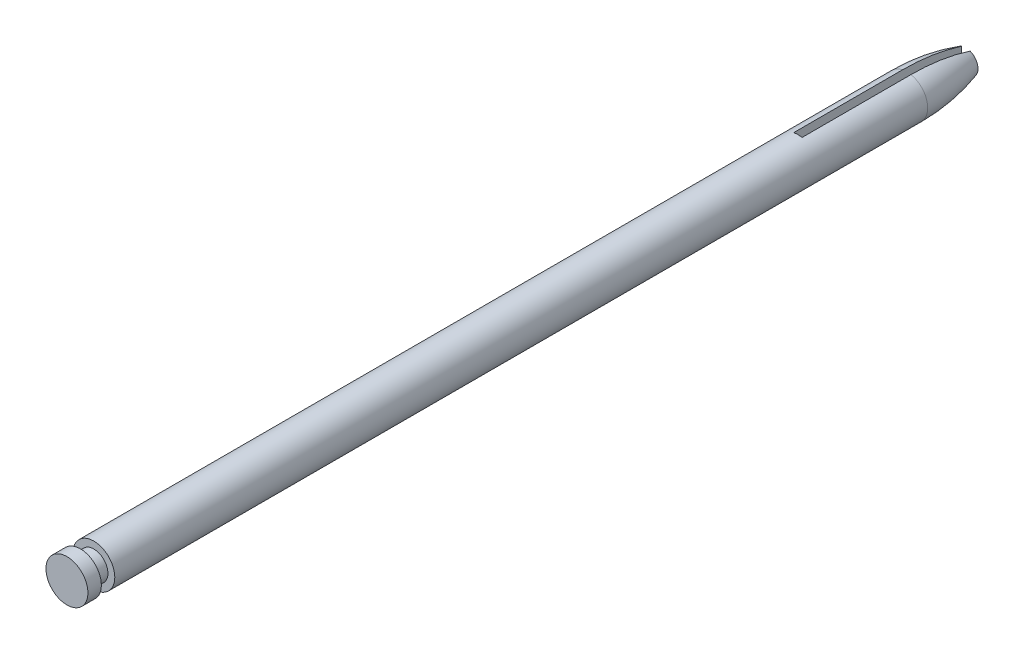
ISO-10303-21;
HEADER;
FILE_DESCRIPTION(('STEP AP214'),'2;1');
FILE_NAME('part.step','',(''),(''),'','','');
FILE_SCHEMA(('AUTOMOTIVE_DESIGN { 1 0 10303 214 1 1 1 1 }'));
ENDSEC;
DATA;
#1=APPLICATION_CONTEXT('core data for automotive mechanical design processes');
#2=APPLICATION_PROTOCOL_DEFINITION('international standard','automotive_design',2000,#1);
#3=PRODUCT_CONTEXT('',#1,'mechanical');
#4=PRODUCT('Part','Part','',(#3));
#5=PRODUCT_RELATED_PRODUCT_CATEGORY('part','',(#4));
#6=PRODUCT_DEFINITION_FORMATION('','',#4);
#7=PRODUCT_DEFINITION_CONTEXT('part definition',#1,'design');
#8=PRODUCT_DEFINITION('design','',#6,#7);
#9=PRODUCT_DEFINITION_SHAPE('','',#8);
#10=(LENGTH_UNIT() NAMED_UNIT(*) SI_UNIT(.MILLI.,.METRE.));
#11=(NAMED_UNIT(*) PLANE_ANGLE_UNIT() SI_UNIT($,.RADIAN.));
#12=(NAMED_UNIT(*) SI_UNIT($,.STERADIAN.) SOLID_ANGLE_UNIT());
#13=UNCERTAINTY_MEASURE_WITH_UNIT(LENGTH_MEASURE(1.E-05),#10,'distance_accuracy_value','');
#14=(GEOMETRIC_REPRESENTATION_CONTEXT(3) GLOBAL_UNCERTAINTY_ASSIGNED_CONTEXT((#13)) GLOBAL_UNIT_ASSIGNED_CONTEXT((#10,
#11,#12)) REPRESENTATION_CONTEXT('',''));
#15=CARTESIAN_POINT('',(0.,0.,0.));
#16=DIRECTION('',(0.,0.,1.));
#17=DIRECTION('',(1.,0.,0.));
#18=AXIS2_PLACEMENT_3D('',#15,#16,#17);
#19=CARTESIAN_POINT('',(0.,0.,-79.34325));
#20=DIRECTION('',(0.,0.,1.));
#21=DIRECTION('',(1.,0.,0.));
#22=AXIS2_PLACEMENT_3D('',#19,#20,#21);
#23=DEGENERATE_TOROIDAL_SURFACE('',#22,17.0688,19.05,.F.);
#24=CARTESIAN_POINT('',(0.,0.,-84.93125));
#25=DIRECTION('',(0.,0.,1.));
#26=DIRECTION('',(1.,0.,0.));
#27=AXIS2_PLACEMENT_3D('',#24,#25,#26);
#28=CIRCLE('',#27,1.14319483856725);
#29=CARTESIAN_POINT('',(-0.396875,1.0720935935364,-84.93125));
#30=VERTEX_POINT('',#29);
#31=CARTESIAN_POINT('',(-0.396875,-1.0720935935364,-84.93125));
#32=VERTEX_POINT('',#31);
#33=EDGE_CURVE('E135',#30,#32,#28,.T.);
#34=ORIENTED_EDGE('',*,*,#33,.T.);
#35=CARTESIAN_POINT('',(-0.396875,0.,-86.9493460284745));
#36=CARTESIAN_POINT('',(-0.396875,-0.0107824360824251,-86.9493458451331));
#37=CARTESIAN_POINT('',(-0.396875,-0.021565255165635,-86.9483229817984));
#38=CARTESIAN_POINT('',(-0.396875,-0.0427815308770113,-86.9443883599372));
#39=CARTESIAN_POINT('',(-0.396875,-0.053214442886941,-86.9414737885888));
#40=CARTESIAN_POINT('',(-0.396875,-0.0773195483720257,-86.9327332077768));
#41=CARTESIAN_POINT('',(-0.396875,-0.0907391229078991,-86.926225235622));
#42=CARTESIAN_POINT('',(-0.396875,-0.116435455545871,-86.911258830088));
#43=CARTESIAN_POINT('',(-0.396875,-0.128708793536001,-86.9027948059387));
#44=CARTESIAN_POINT('',(-0.396875,-0.155961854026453,-86.8817320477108));
#45=CARTESIAN_POINT('',(-0.396875,-0.170577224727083,-86.8686704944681));
#46=CARTESIAN_POINT('',(-0.396875,-0.198515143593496,-86.8412148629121));
#47=CARTESIAN_POINT('',(-0.396875,-0.211834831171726,-86.8268179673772));
#48=CARTESIAN_POINT('',(-0.396875,-0.237562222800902,-86.7970789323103));
#49=CARTESIAN_POINT('',(-0.396875,-0.24996355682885,-86.7817313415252));
#50=CARTESIAN_POINT('',(-0.396875,-0.273975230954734,-86.7504622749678));
#51=CARTESIAN_POINT('',(-0.396875,-0.285586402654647,-86.7345414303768));
#52=CARTESIAN_POINT('',(-0.396875,-0.321806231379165,-86.6828866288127));
#53=CARTESIAN_POINT('',(-0.396875,-0.345257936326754,-86.6463448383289));
#54=CARTESIAN_POINT('',(-0.396875,-0.390299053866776,-86.5721228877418));
#55=CARTESIAN_POINT('',(-0.396875,-0.411887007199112,-86.5344418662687));
#56=CARTESIAN_POINT('',(-0.396875,-0.453764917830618,-86.4582573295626));
#57=CARTESIAN_POINT('',(-0.396875,-0.474051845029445,-86.4197521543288));
#58=CARTESIAN_POINT('',(-0.396875,-0.513595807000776,-86.3422147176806));
#59=CARTESIAN_POINT('',(-0.396875,-0.532852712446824,-86.3031823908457));
#60=CARTESIAN_POINT('',(-0.396875,-0.58939622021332,-86.1854854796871));
#61=CARTESIAN_POINT('',(-0.396875,-0.625451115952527,-86.1062294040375));
#62=CARTESIAN_POINT('',(-0.396875,-0.695124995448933,-85.9468030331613));
#63=CARTESIAN_POINT('',(-0.396875,-0.728747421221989,-85.8666342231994));
#64=CARTESIAN_POINT('',(-0.396875,-0.79399554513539,-85.7056378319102));
#65=CARTESIAN_POINT('',(-0.396875,-0.825624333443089,-85.6248115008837));
#66=CARTESIAN_POINT('',(-0.396875,-0.887194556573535,-85.4625182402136));
#67=CARTESIAN_POINT('',(-0.396875,-0.917135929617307,-85.3810512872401));
#68=CARTESIAN_POINT('',(-0.396875,-1.00467914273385,-85.1358013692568));
#69=CARTESIAN_POINT('',(-0.396875,-1.05998911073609,-84.9711967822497));
#70=CARTESIAN_POINT('',(-0.396875,-1.16521786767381,-84.6400428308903));
#71=CARTESIAN_POINT('',(-0.396875,-1.21512939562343,-84.4734911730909));
#72=CARTESIAN_POINT('',(-0.396875,-1.3097587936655,-84.1389436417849));
#73=CARTESIAN_POINT('',(-0.396875,-1.35447716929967,-83.9709479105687));
#74=CARTESIAN_POINT('',(-0.396875,-1.48107967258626,-83.4651461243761));
#75=CARTESIAN_POINT('',(-0.396875,-1.55544238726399,-83.1254262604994));
#76=CARTESIAN_POINT('',(-0.396875,-1.68454646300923,-82.4425150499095));
#77=CARTESIAN_POINT('',(-0.396875,-1.73929785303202,-82.0993255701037));
#78=CARTESIAN_POINT('',(-0.396875,-1.85219465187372,-81.235780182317));
#79=CARTESIAN_POINT('',(-0.396875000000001,-1.89800441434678,-80.7137604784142));
#80=CARTESIAN_POINT('',(-0.396875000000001,-1.94558309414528,-79.6674252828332));
#81=CARTESIAN_POINT('',(-0.396875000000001,-1.94732305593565,-79.1431085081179));
#82=CARTESIAN_POINT('',(-0.396875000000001,-1.90671472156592,-78.0967646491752));
#83=CARTESIAN_POINT('',(-0.396875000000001,-1.86441427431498,-77.5747356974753));
#84=CARTESIAN_POINT('',(-0.396875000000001,-1.73580139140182,-76.5363930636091));
#85=CARTESIAN_POINT('',(-0.396875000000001,-1.64952063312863,-76.0200755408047));
#86=CARTESIAN_POINT('',(-0.396875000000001,-1.49892954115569,-75.3104680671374));
#87=CARTESIAN_POINT('',(-0.396875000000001,-1.45353217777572,-75.1130275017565));
#88=CARTESIAN_POINT('',(-0.396875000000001,-1.3559118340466,-74.7198151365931));
#89=CARTESIAN_POINT('',(-0.396875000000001,-1.30368857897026,-74.5240434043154));
#90=CARTESIAN_POINT('',(-0.396875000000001,-1.19219252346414,-74.1345884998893));
#91=CARTESIAN_POINT('',(-0.396875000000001,-1.13292200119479,-73.9409046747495));
#92=CARTESIAN_POINT('',(-0.396875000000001,-1.00683910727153,-73.5560780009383));
#93=CARTESIAN_POINT('',(-0.396875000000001,-0.940030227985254,-73.3649340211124));
#94=CARTESIAN_POINT('',(-0.396875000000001,-0.832697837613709,-73.0796872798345));
#95=CARTESIAN_POINT('',(-0.396875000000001,-0.795507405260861,-72.9843251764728));
#96=CARTESIAN_POINT('',(-0.396875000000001,-0.718386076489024,-72.7946018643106));
#97=CARTESIAN_POINT('',(-0.396875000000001,-0.678452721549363,-72.7002416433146));
#98=CARTESIAN_POINT('',(-0.396875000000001,-0.615865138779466,-72.559762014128));
#99=CARTESIAN_POINT('',(-0.396875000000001,-0.594526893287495,-72.5130556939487));
#100=CARTESIAN_POINT('',(-0.396875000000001,-0.550775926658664,-72.4201504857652));
#101=CARTESIAN_POINT('',(-0.396875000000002,-0.528363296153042,-72.3739515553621));
#102=CARTESIAN_POINT('',(-0.396875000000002,-0.482207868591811,-72.2823121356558));
#103=CARTESIAN_POINT('',(-0.396875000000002,-0.458467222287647,-72.236870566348));
#104=CARTESIAN_POINT('',(-0.396875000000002,-0.409147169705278,-72.1470028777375));
#105=CARTESIAN_POINT('',(-0.396875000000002,-0.383568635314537,-72.1025762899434));
#106=CARTESIAN_POINT('',(-0.396875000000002,-0.342993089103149,-72.0370600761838));
#107=CARTESIAN_POINT('',(-0.396875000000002,-0.329040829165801,-72.0153256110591));
#108=CARTESIAN_POINT('',(-0.396875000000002,-0.300185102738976,-71.972452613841));
#109=CARTESIAN_POINT('',(-0.396875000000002,-0.285280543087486,-71.9513148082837));
#110=CARTESIAN_POINT('',(-0.396875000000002,-0.254321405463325,-71.9101132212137));
#111=CARTESIAN_POINT('',(-0.396875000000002,-0.238275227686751,-71.89004317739));
#112=CARTESIAN_POINT('',(-0.396875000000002,-0.204472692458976,-71.8514186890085));
#113=CARTESIAN_POINT('',(-0.396875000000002,-0.18672047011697,-71.832860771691));
#114=CARTESIAN_POINT('',(-0.396875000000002,-0.155889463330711,-71.8049702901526));
#115=CARTESIAN_POINT('',(-0.396875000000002,-0.143578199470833,-71.7948008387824));
#116=CARTESIAN_POINT('',(-0.396875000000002,-0.117744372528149,-71.7761096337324));
#117=CARTESIAN_POINT('',(-0.396875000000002,-0.104223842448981,-71.7675851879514));
#118=CARTESIAN_POINT('',(-0.396875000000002,-0.080120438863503,-71.7552992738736));
#119=CARTESIAN_POINT('',(-0.396875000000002,-0.0698808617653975,-71.7508766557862));
#120=CARTESIAN_POINT('',(-0.396875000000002,-0.0488279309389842,-71.7437180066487));
#121=CARTESIAN_POINT('',(-0.396875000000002,-0.0380156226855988,-71.7409790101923));
#122=CARTESIAN_POINT('',(-0.396875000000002,-0.0159508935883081,-71.7375374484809));
#123=CARTESIAN_POINT('',(-0.396875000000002,-0.00469524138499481,-71.7368547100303));
#124=CARTESIAN_POINT('',(-0.396875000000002,0.017733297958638,-71.7376991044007));
#125=CARTESIAN_POINT('',(-0.396875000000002,0.0289061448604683,-71.7392272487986));
#126=CARTESIAN_POINT('',(-0.396875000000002,0.0519968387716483,-71.7445250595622));
#127=CARTESIAN_POINT('',(-0.396875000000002,0.0638602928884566,-71.7485240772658));
#128=CARTESIAN_POINT('',(-0.396875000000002,0.0867937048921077,-71.7583649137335));
#129=CARTESIAN_POINT('',(-0.396875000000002,0.0978617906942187,-71.7642109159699));
#130=CARTESIAN_POINT('',(-0.396875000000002,0.127577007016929,-71.7822937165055));
#131=CARTESIAN_POINT('',(-0.396875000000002,0.145346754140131,-71.795942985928));
#132=CARTESIAN_POINT('',(-0.396875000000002,0.178933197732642,-71.8254498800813));
#133=CARTESIAN_POINT('',(-0.396875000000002,0.194742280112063,-71.8413156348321));
#134=CARTESIAN_POINT('',(-0.396875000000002,0.223846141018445,-71.8731568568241));
#135=CARTESIAN_POINT('',(-0.396875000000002,0.237239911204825,-71.8890430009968));
#136=CARTESIAN_POINT('',(-0.396875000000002,0.263098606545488,-71.9215593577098));
#137=CARTESIAN_POINT('',(-0.396875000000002,0.27556294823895,-71.9381900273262));
#138=CARTESIAN_POINT('',(-0.396875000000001,0.311941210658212,-71.9889155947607));
#139=CARTESIAN_POINT('',(-0.396875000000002,0.334782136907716,-72.023775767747));
#140=CARTESIAN_POINT('',(-0.396875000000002,0.378734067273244,-72.0947966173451));
#141=CARTESIAN_POINT('',(-0.396875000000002,0.399835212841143,-72.1309632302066));
#142=CARTESIAN_POINT('',(-0.396875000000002,0.440672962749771,-72.203986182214));
#143=CARTESIAN_POINT('',(-0.396875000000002,0.460411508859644,-72.2408414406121));
#144=CARTESIAN_POINT('',(-0.396875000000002,0.517712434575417,-72.3513637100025));
#145=CARTESIAN_POINT('',(-0.396875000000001,0.553825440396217,-72.425778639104));
#146=CARTESIAN_POINT('',(-0.396875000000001,0.623453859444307,-72.575822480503));
#147=CARTESIAN_POINT('',(-0.396875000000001,0.656968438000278,-72.651451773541));
#148=CARTESIAN_POINT('',(-0.396875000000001,0.722017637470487,-72.8036823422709));
#149=CARTESIAN_POINT('',(-0.396875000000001,0.753549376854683,-72.8802848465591));
#150=CARTESIAN_POINT('',(-0.396875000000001,0.814906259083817,-73.0341544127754));
#151=CARTESIAN_POINT('',(-0.396875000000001,0.844731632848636,-73.1114213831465));
#152=CARTESIAN_POINT('',(-0.396875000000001,0.931773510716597,-73.3435593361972));
#153=CARTESIAN_POINT('',(-0.396875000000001,0.986765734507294,-73.4992677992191));
#154=CARTESIAN_POINT('',(-0.396875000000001,1.09157110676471,-73.8122890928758));
#155=CARTESIAN_POINT('',(-0.396875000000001,1.141387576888,-73.96960082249));
#156=CARTESIAN_POINT('',(-0.396875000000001,1.26118741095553,-74.3687712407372));
#157=CARTESIAN_POINT('',(-0.396875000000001,1.32800010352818,-74.6115887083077));
#158=CARTESIAN_POINT('',(-0.396875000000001,1.45108270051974,-75.099893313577));
#159=CARTESIAN_POINT('',(-0.396875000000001,1.50735075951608,-75.3453809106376));
#160=CARTESIAN_POINT('',(-0.396875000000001,1.6607637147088,-76.0855321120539));
#161=CARTESIAN_POINT('',(-0.396875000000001,1.74240302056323,-76.5834980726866));
#162=CARTESIAN_POINT('',(-0.396875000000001,1.86510514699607,-77.5868950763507));
#163=CARTESIAN_POINT('',(-0.396875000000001,1.90595919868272,-78.0923512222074));
#164=CARTESIAN_POINT('',(-0.396875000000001,1.94638596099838,-79.1045313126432));
#165=CARTESIAN_POINT('',(-0.396875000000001,1.94598949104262,-79.6112540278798));
#166=CARTESIAN_POINT('',(-0.396875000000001,1.90396028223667,-80.6236609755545));
#167=CARTESIAN_POINT('',(-0.396875,1.86227818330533,-81.129343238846));
#168=CARTESIAN_POINT('',(-0.396875,1.76871168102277,-81.8842414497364));
#169=CARTESIAN_POINT('',(-0.396875,1.73230823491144,-82.1354653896));
#170=CARTESIAN_POINT('',(-0.396875,1.64909518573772,-82.6361766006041));
#171=CARTESIAN_POINT('',(-0.396875,1.60228665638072,-82.8856640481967));
#172=CARTESIAN_POINT('',(-0.396875,1.49851160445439,-83.3807716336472));
#173=CARTESIAN_POINT('',(-0.396875,1.4416150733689,-83.6264064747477));
#174=CARTESIAN_POINT('',(-0.396875,1.31720742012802,-84.1150848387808));
#175=CARTESIAN_POINT('',(-0.396875,1.24969265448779,-84.3581274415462));
#176=CARTESIAN_POINT('',(-0.396875,1.1400914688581,-84.7198858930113));
#177=CARTESIAN_POINT('',(-0.396875,1.10221099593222,-84.8398875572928));
#178=CARTESIAN_POINT('',(-0.396875,1.02349451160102,-85.0789154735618));
#179=CARTESIAN_POINT('',(-0.396875,0.982658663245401,-85.1979417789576));
#180=CARTESIAN_POINT('',(-0.396875,0.89777578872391,-85.4347692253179));
#181=CARTESIAN_POINT('',(-0.396875,0.853730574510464,-85.552571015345));
#182=CARTESIAN_POINT('',(-0.396875,0.761903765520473,-85.7867013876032));
#183=CARTESIAN_POINT('',(-0.396875,0.714122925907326,-85.9030302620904));
#184=CARTESIAN_POINT('',(-0.396875,0.650423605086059,-86.0491557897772));
#185=CARTESIAN_POINT('',(-0.396875,0.636789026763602,-86.0799511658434));
#186=CARTESIAN_POINT('',(-0.396875,0.609117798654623,-86.1413604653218));
#187=CARTESIAN_POINT('',(-0.396875,0.595081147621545,-86.1719743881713));
#188=CARTESIAN_POINT('',(-0.396875,0.552294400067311,-86.2635191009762));
#189=CARTESIAN_POINT('',(-0.396875,0.522872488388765,-86.3241413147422));
#190=CARTESIAN_POINT('',(-0.396875,0.471686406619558,-86.4243072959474));
#191=CARTESIAN_POINT('',(-0.396875,0.450603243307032,-86.4641987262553));
#192=CARTESIAN_POINT('',(-0.396875,0.406980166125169,-86.5431391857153));
#193=CARTESIAN_POINT('',(-0.396875,0.384441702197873,-86.5821890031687));
#194=CARTESIAN_POINT('',(-0.396875,0.344939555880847,-86.6464691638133));
#195=CARTESIAN_POINT('',(-0.396875,0.328554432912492,-86.6720537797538));
#196=CARTESIAN_POINT('',(-0.396875,0.294422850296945,-86.7224189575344));
#197=CARTESIAN_POINT('',(-0.396875,0.276672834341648,-86.7471971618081));
#198=CARTESIAN_POINT('',(-0.396875,0.239135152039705,-86.7955214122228));
#199=CARTESIAN_POINT('',(-0.396875,0.21933060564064,-86.8190543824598));
#200=CARTESIAN_POINT('',(-0.396875,0.176845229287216,-86.8633948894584));
#201=CARTESIAN_POINT('',(-0.396875,0.15417958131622,-86.884215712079));
#202=CARTESIAN_POINT('',(-0.396875,0.11897061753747,-86.9094189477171));
#203=CARTESIAN_POINT('',(-0.396875,0.108252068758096,-86.9162974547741));
#204=CARTESIAN_POINT('',(-0.396875,0.0859631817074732,-86.9285139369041));
#205=CARTESIAN_POINT('',(-0.396875,0.0743942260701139,-86.9338543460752));
#206=CARTESIAN_POINT('',(-0.396875,0.0524243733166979,-86.9417054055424));
#207=CARTESIAN_POINT('',(-0.396875,0.0421403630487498,-86.9445353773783));
#208=CARTESIAN_POINT('',(-0.396875,0.021237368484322,-86.9483545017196));
#209=CARTESIAN_POINT('',(-0.396875,0.010618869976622,-86.9493462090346));
#210=CARTESIAN_POINT('',(-0.396875,0.,-86.9493460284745));
#211=B_SPLINE_CURVE_WITH_KNOTS('',3,(#35,#36,#37,#38,#39,#40,#41,#42,#43,#44,#45,#46,#47,#48,
#49,#50,#51,#52,#53,#54,#55,#56,#57,#58,#59,#60,#61,#62,#63,#64,#65,#66,#67,#68,#69,#70,#71,#72,
#73,#74,#75,#76,#77,#78,#79,#80,#81,#82,#83,#84,#85,#86,#87,#88,#89,#90,#91,#92,#93,#94,#95,#96,
#97,#98,#99,#100,#101,#102,#103,#104,#105,#106,#107,#108,#109,#110,#111,#112,#113,#114,#115,
#116,#117,#118,#119,#120,#121,#122,#123,#124,#125,#126,#127,#128,#129,#130,#131,#132,#133,#134,
#135,#136,#137,#138,#139,#140,#141,#142,#143,#144,#145,#146,#147,#148,#149,#150,#151,#152,#153,
#154,#155,#156,#157,#158,#159,#160,#161,#162,#163,#164,#165,#166,#167,#168,#169,#170,#171,#172,
#173,#174,#175,#176,#177,#178,#179,#180,#181,#182,#183,#184,#185,#186,#187,#188,#189,#190,#191,
#192,#193,#194,#195,#196,#197,#198,#199,#200,#201,#202,#203,#204,#205,#206,#207,#208,#209,#210),
.UNSPECIFIED.,.T.,.F.,(4,2,2,2,2,2,2,2,2,2,2,2,2,2,2,2,2,2,2,2,2,2,2,2,2,2,2,2,2,2,2,2,2,2,2,2,
2,2,2,2,2,2,2,2,2,2,2,2,2,2,2,2,2,2,2,2,2,2,2,2,2,2,2,2,2,2,2,2,2,2,2,2,2,2,2,2,2,2,2,2,2,2,2,2,
2,2,2,4),(0.,0.0323040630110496,0.0646562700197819,0.109142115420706,0.15375671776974,
0.212416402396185,0.271202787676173,0.330364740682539,0.389463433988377,0.519614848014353,
0.649867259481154,0.78041276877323,0.910974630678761,1.17212701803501,1.43290233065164,
1.69326295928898,1.95363311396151,2.47446200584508,2.99598293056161,3.51745304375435,
4.56008174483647,5.60217649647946,7.17226576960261,8.74338662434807,10.3128022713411,
11.8810891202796,12.4887798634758,13.0964950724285,13.7040143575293,14.3112533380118,
14.6182981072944,14.9256217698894,15.0796614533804,15.2336881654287,15.3874722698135,
15.5411838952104,15.6186497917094,15.6962062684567,15.7732416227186,15.8500947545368,
15.8979187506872,15.9456638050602,15.9790141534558,16.0123055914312,16.0459170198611,
16.0795438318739,16.1168920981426,16.1543255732,16.221169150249,16.288264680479,
16.3505524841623,16.4128790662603,16.5378004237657,16.6633869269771,16.7887906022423,
17.0368479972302,17.2849847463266,17.5334741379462,17.7819298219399,18.27721425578,
18.772178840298,19.5274247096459,20.2828026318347,21.7947625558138,23.3144227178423,
24.8329475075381,26.3532900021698,27.1146551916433,27.87594185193,28.6321397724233,
29.3885977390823,29.7660832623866,30.1435479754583,30.5208012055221,30.8979783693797,
30.9990120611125,31.1000460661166,31.3021517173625,31.4374935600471,31.5727025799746,
31.6638239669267,31.7551913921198,31.8473800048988,31.9390985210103,31.9772200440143,
32.0152809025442,32.0471392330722,32.0789532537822),.UNSPECIFIED.);
#212=CARTESIAN_POINT('',(-0.396875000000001,-1.94104190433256,-79.34325));
#213=VERTEX_POINT('',#212);
#214=EDGE_CURVE('E140',#32,#213,#211,.T.);
#215=ORIENTED_EDGE('',*,*,#214,.T.);
#216=CARTESIAN_POINT('',(0.,0.,-79.34325));
#217=DIRECTION('',(0.,0.,1.));
#218=DIRECTION('',(1.,0.,0.));
#219=AXIS2_PLACEMENT_3D('',#216,#217,#218);
#220=CIRCLE('',#219,1.9812);
#221=CARTESIAN_POINT('',(-0.396875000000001,1.94104190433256,-79.34325));
#222=VERTEX_POINT('',#221);
#223=EDGE_CURVE('E132',#222,#213,#220,.T.);
#224=ORIENTED_EDGE('',*,*,#223,.F.);
#225=EDGE_CURVE('E144',#222,#30,#211,.T.);
#226=ORIENTED_EDGE('',*,*,#225,.T.);
#227=EDGE_LOOP('',(#34,#215,#224,#226));
#228=FACE_BOUND('',#227,.T.);
#229=ADVANCED_FACE('F36',(#228),#23,.F.);
#230=CARTESIAN_POINT('',(0.,0.,-84.93125));
#231=DIRECTION('',(0.,0.,1.));
#232=DIRECTION('',(1.,0.,0.));
#233=AXIS2_PLACEMENT_3D('',#230,#231,#232);
#234=PLANE('',#233);
#235=ORIENTED_EDGE('',*,*,#33,.F.);
#236=DIRECTION('',(0.,-1.,0.));
#237=VECTOR('',#236,1.);
#238=CARTESIAN_POINT('',(-0.396875,0.,-84.93125));
#239=LINE('',#238,#237);
#240=EDGE_CURVE('E109',#30,#32,#239,.T.);
#241=ORIENTED_EDGE('',*,*,#240,.T.);
#242=EDGE_LOOP('',(#235,#241));
#243=FACE_BOUND('',#242,.T.);
#244=ADVANCED_FACE('F164',(#243),#234,.F.);
#245=CARTESIAN_POINT('',(0.,0.,0.));
#246=DIRECTION('',(0.,0.,-1.));
#247=DIRECTION('',(-1.,0.,0.));
#248=AXIS2_PLACEMENT_3D('',#245,#246,#247);
#249=PLANE('',#248);
#250=CARTESIAN_POINT('',(0.,0.,0.));
#251=DIRECTION('',(0.,0.,1.));
#252=DIRECTION('',(1.,0.,0.));
#253=AXIS2_PLACEMENT_3D('',#250,#251,#252);
#254=CIRCLE('',#253,1.9812);
#255=CARTESIAN_POINT('',(1.9812,0.,0.));
#256=VERTEX_POINT('',#255);
#257=EDGE_CURVE('E115',#256,#256,#254,.T.);
#258=ORIENTED_EDGE('',*,*,#257,.T.);
#259=EDGE_LOOP('',(#258));
#260=FACE_BOUND('',#259,.T.);
#261=ADVANCED_FACE('F38',(#260),#249,.F.);
#262=CARTESIAN_POINT('',(0.,0.,0.));
#263=DIRECTION('',(0.,0.,1.));
#264=DIRECTION('',(1.,0.,0.));
#265=AXIS2_PLACEMENT_3D('',#262,#263,#264);
#266=CYLINDRICAL_SURFACE('',#265,1.9812);
#267=ORIENTED_EDGE('',*,*,#257,.F.);
#268=EDGE_LOOP('',(#267));
#269=FACE_BOUND('',#268,.T.);
#270=CARTESIAN_POINT('',(0.,0.,-1.27));
#271=DIRECTION('',(0.,0.,1.));
#272=DIRECTION('',(1.,0.,0.));
#273=AXIS2_PLACEMENT_3D('',#270,#271,#272);
#274=CIRCLE('',#273,1.9812);
#275=CARTESIAN_POINT('',(1.9812,0.,-1.27));
#276=VERTEX_POINT('',#275);
#277=EDGE_CURVE('E120',#276,#276,#274,.T.);
#278=ORIENTED_EDGE('',*,*,#277,.T.);
#279=EDGE_LOOP('',(#278));
#280=FACE_BOUND('',#279,.T.);
#281=ADVANCED_FACE('F242',(#269,#280),#266,.T.);
#282=CARTESIAN_POINT('',(0.,1.9812,-1.27));
#283=DIRECTION('',(0.,0.,1.));
#284=DIRECTION('',(1.,0.,0.));
#285=AXIS2_PLACEMENT_3D('',#282,#283,#284);
#286=PLANE('',#285);
#287=ORIENTED_EDGE('',*,*,#277,.F.);
#288=EDGE_LOOP('',(#287));
#289=FACE_BOUND('',#288,.T.);
#290=CARTESIAN_POINT('',(0.,0.,-1.27));
#291=DIRECTION('',(0.,0.,1.));
#292=DIRECTION('',(1.,0.,0.));
#293=AXIS2_PLACEMENT_3D('',#290,#291,#292);
#294=CIRCLE('',#293,1.3335);
#295=CARTESIAN_POINT('',(1.3335,0.,-1.27));
#296=VERTEX_POINT('',#295);
#297=EDGE_CURVE('E123',#296,#296,#294,.T.);
#298=ORIENTED_EDGE('',*,*,#297,.T.);
#299=EDGE_LOOP('',(#298));
#300=FACE_BOUND('',#299,.T.);
#301=ADVANCED_FACE('F234',(#289,#300),#286,.F.);
#302=CARTESIAN_POINT('',(0.,0.,0.));
#303=DIRECTION('',(0.,0.,1.));
#304=DIRECTION('',(1.,0.,0.));
#305=AXIS2_PLACEMENT_3D('',#302,#303,#304);
#306=CYLINDRICAL_SURFACE('',#305,1.3335);
#307=ORIENTED_EDGE('',*,*,#297,.F.);
#308=EDGE_LOOP('',(#307));
#309=FACE_BOUND('',#308,.T.);
#310=CARTESIAN_POINT('',(0.,0.,-2.54));
#311=DIRECTION('',(0.,0.,1.));
#312=DIRECTION('',(1.,0.,0.));
#313=AXIS2_PLACEMENT_3D('',#310,#311,#312);
#314=CIRCLE('',#313,1.3335);
#315=CARTESIAN_POINT('',(1.3335,0.,-2.54));
#316=VERTEX_POINT('',#315);
#317=EDGE_CURVE('E126',#316,#316,#314,.T.);
#318=ORIENTED_EDGE('',*,*,#317,.T.);
#319=EDGE_LOOP('',(#318));
#320=FACE_BOUND('',#319,.T.);
#321=ADVANCED_FACE('F227',(#309,#320),#306,.T.);
#322=CARTESIAN_POINT('',(0.,1.3335,-2.54));
#323=DIRECTION('',(0.,0.,-1.));
#324=DIRECTION('',(-1.,0.,0.));
#325=AXIS2_PLACEMENT_3D('',#322,#323,#324);
#326=PLANE('',#325);
#327=ORIENTED_EDGE('',*,*,#317,.F.);
#328=EDGE_LOOP('',(#327));
#329=FACE_BOUND('',#328,.T.);
#330=CARTESIAN_POINT('',(0.,0.,-2.54));
#331=DIRECTION('',(0.,0.,1.));
#332=DIRECTION('',(1.,0.,0.));
#333=AXIS2_PLACEMENT_3D('',#330,#331,#332);
#334=CIRCLE('',#333,1.9812);
#335=CARTESIAN_POINT('',(1.9812,0.,-2.54));
#336=VERTEX_POINT('',#335);
#337=EDGE_CURVE('E129',#336,#336,#334,.T.);
#338=ORIENTED_EDGE('',*,*,#337,.T.);
#339=EDGE_LOOP('',(#338));
#340=FACE_BOUND('',#339,.T.);
#341=ADVANCED_FACE('F220',(#329,#340),#326,.F.);
#342=CARTESIAN_POINT('',(0.,0.,0.));
#343=DIRECTION('',(0.,0.,1.));
#344=DIRECTION('',(1.,0.,0.));
#345=AXIS2_PLACEMENT_3D('',#342,#343,#344);
#346=CYLINDRICAL_SURFACE('',#345,1.9812);
#347=CARTESIAN_POINT('',(0.,0.,-69.05625));
#348=DIRECTION('',(0.,0.,1.));
#349=DIRECTION('',(1.,0.,0.));
#350=AXIS2_PLACEMENT_3D('',#347,#348,#349);
#351=CIRCLE('',#350,1.9812);
#352=CARTESIAN_POINT('',(0.396875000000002,1.94104190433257,-69.05625));
#353=VERTEX_POINT('',#352);
#354=CARTESIAN_POINT('',(-0.396875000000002,1.94104190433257,-69.05625));
#355=VERTEX_POINT('',#354);
#356=EDGE_CURVE('E11',#353,#355,#351,.T.);
#357=ORIENTED_EDGE('',*,*,#356,.T.);
#358=DIRECTION('',(0.,0.,1.));
#359=VECTOR('',#358,1.);
#360=CARTESIAN_POINT('',(-0.39687500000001,1.94104190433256,0.));
#361=LINE('',#360,#359);
#362=EDGE_CURVE('E141',#355,#222,#361,.F.);
#363=ORIENTED_EDGE('',*,*,#362,.T.);
#364=ORIENTED_EDGE('',*,*,#223,.T.);
#365=DIRECTION('',(0.,0.,1.));
#366=VECTOR('',#365,1.);
#367=CARTESIAN_POINT('',(-0.39687500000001,-1.94104190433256,0.));
#368=LINE('',#367,#366);
#369=CARTESIAN_POINT('',(-0.396875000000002,-1.94104190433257,-69.05625));
#370=VERTEX_POINT('',#369);
#371=EDGE_CURVE('E59',#213,#370,#368,.T.);
#372=ORIENTED_EDGE('',*,*,#371,.T.);
#373=CARTESIAN_POINT('',(0.396875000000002,-1.94104190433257,-69.05625));
#374=VERTEX_POINT('',#373);
#375=EDGE_CURVE('E40',#370,#374,#351,.T.);
#376=ORIENTED_EDGE('',*,*,#375,.T.);
#377=DIRECTION('',(0.,0.,1.));
#378=VECTOR('',#377,1.);
#379=CARTESIAN_POINT('',(0.39687500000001,-1.94104190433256,0.));
#380=LINE('',#379,#378);
#381=CARTESIAN_POINT('',(0.396875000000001,-1.94104190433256,-79.34325));
#382=VERTEX_POINT('',#381);
#383=EDGE_CURVE('E89',#374,#382,#380,.F.);
#384=ORIENTED_EDGE('',*,*,#383,.T.);
#385=CARTESIAN_POINT('',(0.396875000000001,1.94104190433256,-79.34325));
#386=VERTEX_POINT('',#385);
#387=EDGE_CURVE('E133',#382,#386,#220,.T.);
#388=ORIENTED_EDGE('',*,*,#387,.T.);
#389=DIRECTION('',(0.,0.,1.));
#390=VECTOR('',#389,1.);
#391=CARTESIAN_POINT('',(0.39687500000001,1.94104190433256,0.));
#392=LINE('',#391,#390);
#393=EDGE_CURVE('E151',#386,#353,#392,.T.);
#394=ORIENTED_EDGE('',*,*,#393,.T.);
#395=EDGE_LOOP('',(#357,#363,#364,#372,#376,#384,#388,#394));
#396=FACE_BOUND('',#395,.T.);
#397=ORIENTED_EDGE('',*,*,#337,.F.);
#398=EDGE_LOOP('',(#397));
#399=FACE_BOUND('',#398,.T.);
#400=ADVANCED_FACE('F106',(#396,#399),#346,.T.);
#401=CARTESIAN_POINT('',(0.396875,-1.0720935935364,-84.93125));
#402=VERTEX_POINT('',#401);
#403=CARTESIAN_POINT('',(0.396875,1.0720935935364,-84.93125));
#404=VERTEX_POINT('',#403);
#405=EDGE_CURVE('E136',#402,#404,#28,.T.);
#406=ORIENTED_EDGE('',*,*,#405,.T.);
#407=CARTESIAN_POINT('',(0.396875,0.,-86.9493460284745));
#408=CARTESIAN_POINT('',(0.396875,0.0107824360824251,-86.9493458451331));
#409=CARTESIAN_POINT('',(0.396875,0.021565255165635,-86.9483229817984));
#410=CARTESIAN_POINT('',(0.396875,0.0427815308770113,-86.9443883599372));
#411=CARTESIAN_POINT('',(0.396875,0.053214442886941,-86.9414737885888));
#412=CARTESIAN_POINT('',(0.396875,0.0773195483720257,-86.9327332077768));
#413=CARTESIAN_POINT('',(0.396875,0.0907391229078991,-86.926225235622));
#414=CARTESIAN_POINT('',(0.396875,0.116435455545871,-86.911258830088));
#415=CARTESIAN_POINT('',(0.396875,0.128708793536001,-86.9027948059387));
#416=CARTESIAN_POINT('',(0.396875,0.155961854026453,-86.8817320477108));
#417=CARTESIAN_POINT('',(0.396875,0.170577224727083,-86.8686704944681));
#418=CARTESIAN_POINT('',(0.396875,0.198515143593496,-86.8412148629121));
#419=CARTESIAN_POINT('',(0.396875,0.211834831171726,-86.8268179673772));
#420=CARTESIAN_POINT('',(0.396875,0.237562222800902,-86.7970789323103));
#421=CARTESIAN_POINT('',(0.396875,0.24996355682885,-86.7817313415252));
#422=CARTESIAN_POINT('',(0.396875,0.273975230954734,-86.7504622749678));
#423=CARTESIAN_POINT('',(0.396875,0.285586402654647,-86.7345414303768));
#424=CARTESIAN_POINT('',(0.396875,0.321806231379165,-86.6828866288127));
#425=CARTESIAN_POINT('',(0.396875,0.345257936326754,-86.6463448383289));
#426=CARTESIAN_POINT('',(0.396875,0.390299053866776,-86.5721228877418));
#427=CARTESIAN_POINT('',(0.396875,0.411887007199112,-86.5344418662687));
#428=CARTESIAN_POINT('',(0.396875,0.453764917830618,-86.4582573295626));
#429=CARTESIAN_POINT('',(0.396875,0.474051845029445,-86.4197521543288));
#430=CARTESIAN_POINT('',(0.396875,0.513595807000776,-86.3422147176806));
#431=CARTESIAN_POINT('',(0.396875,0.532852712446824,-86.3031823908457));
#432=CARTESIAN_POINT('',(0.396875,0.58939622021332,-86.1854854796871));
#433=CARTESIAN_POINT('',(0.396875,0.625451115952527,-86.1062294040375));
#434=CARTESIAN_POINT('',(0.396875,0.695124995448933,-85.9468030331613));
#435=CARTESIAN_POINT('',(0.396875,0.728747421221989,-85.8666342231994));
#436=CARTESIAN_POINT('',(0.396875,0.79399554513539,-85.7056378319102));
#437=CARTESIAN_POINT('',(0.396875,0.825624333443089,-85.6248115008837));
#438=CARTESIAN_POINT('',(0.396875,0.887194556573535,-85.4625182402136));
#439=CARTESIAN_POINT('',(0.396875,0.917135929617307,-85.3810512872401));
#440=CARTESIAN_POINT('',(0.396875,1.00467914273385,-85.1358013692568));
#441=CARTESIAN_POINT('',(0.396875,1.05998911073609,-84.9711967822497));
#442=CARTESIAN_POINT('',(0.396875,1.16521786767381,-84.6400428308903));
#443=CARTESIAN_POINT('',(0.396875,1.21512939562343,-84.4734911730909));
#444=CARTESIAN_POINT('',(0.396875,1.3097587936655,-84.1389436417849));
#445=CARTESIAN_POINT('',(0.396875,1.35447716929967,-83.9709479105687));
#446=CARTESIAN_POINT('',(0.396875,1.48107967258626,-83.4651461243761));
#447=CARTESIAN_POINT('',(0.396875,1.55544238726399,-83.1254262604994));
#448=CARTESIAN_POINT('',(0.396875,1.68454646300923,-82.4425150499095));
#449=CARTESIAN_POINT('',(0.396875,1.73929785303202,-82.0993255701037));
#450=CARTESIAN_POINT('',(0.396875,1.85219465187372,-81.235780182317));
#451=CARTESIAN_POINT('',(0.396875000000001,1.89800441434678,-80.7137604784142));
#452=CARTESIAN_POINT('',(0.396875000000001,1.94558309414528,-79.6674252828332));
#453=CARTESIAN_POINT('',(0.396875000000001,1.94732305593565,-79.1431085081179));
#454=CARTESIAN_POINT('',(0.396875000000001,1.90671472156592,-78.0967646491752));
#455=CARTESIAN_POINT('',(0.396875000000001,1.86441427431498,-77.5747356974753));
#456=CARTESIAN_POINT('',(0.396875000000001,1.73580139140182,-76.5363930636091));
#457=CARTESIAN_POINT('',(0.396875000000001,1.64952063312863,-76.0200755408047));
#458=CARTESIAN_POINT('',(0.396875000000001,1.49892954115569,-75.3104680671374));
#459=CARTESIAN_POINT('',(0.396875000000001,1.45353217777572,-75.1130275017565));
#460=CARTESIAN_POINT('',(0.396875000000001,1.3559118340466,-74.7198151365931));
#461=CARTESIAN_POINT('',(0.396875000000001,1.30368857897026,-74.5240434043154));
#462=CARTESIAN_POINT('',(0.396875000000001,1.19219252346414,-74.1345884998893));
#463=CARTESIAN_POINT('',(0.396875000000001,1.13292200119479,-73.9409046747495));
#464=CARTESIAN_POINT('',(0.396875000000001,1.00683910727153,-73.5560780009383));
#465=CARTESIAN_POINT('',(0.396875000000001,0.940030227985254,-73.3649340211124));
#466=CARTESIAN_POINT('',(0.396875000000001,0.832697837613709,-73.0796872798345));
#467=CARTESIAN_POINT('',(0.396875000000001,0.795507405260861,-72.9843251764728));
#468=CARTESIAN_POINT('',(0.396875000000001,0.718386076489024,-72.7946018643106));
#469=CARTESIAN_POINT('',(0.396875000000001,0.678452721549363,-72.7002416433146));
#470=CARTESIAN_POINT('',(0.396875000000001,0.615865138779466,-72.559762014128));
#471=CARTESIAN_POINT('',(0.396875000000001,0.594526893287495,-72.5130556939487));
#472=CARTESIAN_POINT('',(0.396875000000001,0.550775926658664,-72.4201504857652));
#473=CARTESIAN_POINT('',(0.396875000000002,0.528363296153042,-72.3739515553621));
#474=CARTESIAN_POINT('',(0.396875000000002,0.482207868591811,-72.2823121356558));
#475=CARTESIAN_POINT('',(0.396875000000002,0.458467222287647,-72.236870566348));
#476=CARTESIAN_POINT('',(0.396875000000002,0.409147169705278,-72.1470028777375));
#477=CARTESIAN_POINT('',(0.396875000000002,0.383568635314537,-72.1025762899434));
#478=CARTESIAN_POINT('',(0.396875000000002,0.342993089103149,-72.0370600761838));
#479=CARTESIAN_POINT('',(0.396875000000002,0.329040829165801,-72.0153256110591));
#480=CARTESIAN_POINT('',(0.396875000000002,0.300185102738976,-71.972452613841));
#481=CARTESIAN_POINT('',(0.396875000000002,0.285280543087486,-71.9513148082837));
#482=CARTESIAN_POINT('',(0.396875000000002,0.254321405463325,-71.9101132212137));
#483=CARTESIAN_POINT('',(0.396875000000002,0.238275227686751,-71.89004317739));
#484=CARTESIAN_POINT('',(0.396875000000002,0.204472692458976,-71.8514186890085));
#485=CARTESIAN_POINT('',(0.396875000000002,0.18672047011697,-71.832860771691));
#486=CARTESIAN_POINT('',(0.396875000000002,0.155889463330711,-71.8049702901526));
#487=CARTESIAN_POINT('',(0.396875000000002,0.143578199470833,-71.7948008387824));
#488=CARTESIAN_POINT('',(0.396875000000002,0.117744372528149,-71.7761096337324));
#489=CARTESIAN_POINT('',(0.396875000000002,0.104223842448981,-71.7675851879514));
#490=CARTESIAN_POINT('',(0.396875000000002,0.080120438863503,-71.7552992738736));
#491=CARTESIAN_POINT('',(0.396875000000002,0.0698808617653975,-71.7508766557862));
#492=CARTESIAN_POINT('',(0.396875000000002,0.0488279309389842,-71.7437180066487));
#493=CARTESIAN_POINT('',(0.396875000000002,0.0380156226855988,-71.7409790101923));
#494=CARTESIAN_POINT('',(0.396875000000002,0.0159508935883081,-71.7375374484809));
#495=CARTESIAN_POINT('',(0.396875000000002,0.00469524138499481,-71.7368547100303));
#496=CARTESIAN_POINT('',(0.396875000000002,-0.017733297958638,-71.7376991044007));
#497=CARTESIAN_POINT('',(0.396875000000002,-0.0289061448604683,-71.7392272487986));
#498=CARTESIAN_POINT('',(0.396875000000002,-0.0519968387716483,-71.7445250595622));
#499=CARTESIAN_POINT('',(0.396875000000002,-0.0638602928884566,-71.7485240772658));
#500=CARTESIAN_POINT('',(0.396875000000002,-0.0867937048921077,-71.7583649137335));
#501=CARTESIAN_POINT('',(0.396875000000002,-0.0978617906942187,-71.7642109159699));
#502=CARTESIAN_POINT('',(0.396875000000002,-0.127577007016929,-71.7822937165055));
#503=CARTESIAN_POINT('',(0.396875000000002,-0.145346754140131,-71.795942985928));
#504=CARTESIAN_POINT('',(0.396875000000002,-0.178933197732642,-71.8254498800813));
#505=CARTESIAN_POINT('',(0.396875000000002,-0.194742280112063,-71.8413156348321));
#506=CARTESIAN_POINT('',(0.396875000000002,-0.223846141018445,-71.8731568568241));
#507=CARTESIAN_POINT('',(0.396875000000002,-0.237239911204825,-71.8890430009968));
#508=CARTESIAN_POINT('',(0.396875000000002,-0.263098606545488,-71.9215593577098));
#509=CARTESIAN_POINT('',(0.396875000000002,-0.27556294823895,-71.9381900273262));
#510=CARTESIAN_POINT('',(0.396875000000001,-0.311941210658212,-71.9889155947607));
#511=CARTESIAN_POINT('',(0.396875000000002,-0.334782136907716,-72.023775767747));
#512=CARTESIAN_POINT('',(0.396875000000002,-0.378734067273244,-72.0947966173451));
#513=CARTESIAN_POINT('',(0.396875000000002,-0.399835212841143,-72.1309632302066));
#514=CARTESIAN_POINT('',(0.396875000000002,-0.440672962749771,-72.203986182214));
#515=CARTESIAN_POINT('',(0.396875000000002,-0.460411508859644,-72.2408414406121));
#516=CARTESIAN_POINT('',(0.396875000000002,-0.517712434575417,-72.3513637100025));
#517=CARTESIAN_POINT('',(0.396875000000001,-0.553825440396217,-72.425778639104));
#518=CARTESIAN_POINT('',(0.396875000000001,-0.623453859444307,-72.575822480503));
#519=CARTESIAN_POINT('',(0.396875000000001,-0.656968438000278,-72.651451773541));
#520=CARTESIAN_POINT('',(0.396875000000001,-0.722017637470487,-72.8036823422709));
#521=CARTESIAN_POINT('',(0.396875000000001,-0.753549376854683,-72.8802848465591));
#522=CARTESIAN_POINT('',(0.396875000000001,-0.814906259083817,-73.0341544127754));
#523=CARTESIAN_POINT('',(0.396875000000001,-0.844731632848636,-73.1114213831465));
#524=CARTESIAN_POINT('',(0.396875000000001,-0.931773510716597,-73.3435593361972));
#525=CARTESIAN_POINT('',(0.396875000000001,-0.986765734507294,-73.4992677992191));
#526=CARTESIAN_POINT('',(0.396875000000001,-1.09157110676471,-73.8122890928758));
#527=CARTESIAN_POINT('',(0.396875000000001,-1.141387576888,-73.96960082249));
#528=CARTESIAN_POINT('',(0.396875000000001,-1.26118741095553,-74.3687712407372));
#529=CARTESIAN_POINT('',(0.396875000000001,-1.32800010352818,-74.6115887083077));
#530=CARTESIAN_POINT('',(0.396875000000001,-1.45108270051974,-75.099893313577));
#531=CARTESIAN_POINT('',(0.396875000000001,-1.50735075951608,-75.3453809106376));
#532=CARTESIAN_POINT('',(0.396875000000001,-1.6607637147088,-76.0855321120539));
#533=CARTESIAN_POINT('',(0.396875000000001,-1.74240302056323,-76.5834980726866));
#534=CARTESIAN_POINT('',(0.396875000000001,-1.86510514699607,-77.5868950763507));
#535=CARTESIAN_POINT('',(0.396875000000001,-1.90595919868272,-78.0923512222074));
#536=CARTESIAN_POINT('',(0.396875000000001,-1.94638596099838,-79.1045313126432));
#537=CARTESIAN_POINT('',(0.396875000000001,-1.94598949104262,-79.6112540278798));
#538=CARTESIAN_POINT('',(0.396875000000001,-1.90396028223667,-80.6236609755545));
#539=CARTESIAN_POINT('',(0.396875,-1.86227818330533,-81.129343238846));
#540=CARTESIAN_POINT('',(0.396875,-1.76871168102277,-81.8842414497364));
#541=CARTESIAN_POINT('',(0.396875,-1.73230823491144,-82.1354653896));
#542=CARTESIAN_POINT('',(0.396875,-1.64909518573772,-82.6361766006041));
#543=CARTESIAN_POINT('',(0.396875,-1.60228665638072,-82.8856640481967));
#544=CARTESIAN_POINT('',(0.396875,-1.49851160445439,-83.3807716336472));
#545=CARTESIAN_POINT('',(0.396875,-1.4416150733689,-83.6264064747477));
#546=CARTESIAN_POINT('',(0.396875,-1.31720742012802,-84.1150848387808));
#547=CARTESIAN_POINT('',(0.396875,-1.24969265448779,-84.3581274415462));
#548=CARTESIAN_POINT('',(0.396875,-1.1400914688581,-84.7198858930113));
#549=CARTESIAN_POINT('',(0.396875,-1.10221099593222,-84.8398875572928));
#550=CARTESIAN_POINT('',(0.396875,-1.02349451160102,-85.0789154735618));
#551=CARTESIAN_POINT('',(0.396875,-0.982658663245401,-85.1979417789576));
#552=CARTESIAN_POINT('',(0.396875,-0.89777578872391,-85.4347692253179));
#553=CARTESIAN_POINT('',(0.396875,-0.853730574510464,-85.552571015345));
#554=CARTESIAN_POINT('',(0.396875,-0.761903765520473,-85.7867013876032));
#555=CARTESIAN_POINT('',(0.396875,-0.714122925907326,-85.9030302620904));
#556=CARTESIAN_POINT('',(0.396875,-0.650423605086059,-86.0491557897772));
#557=CARTESIAN_POINT('',(0.396875,-0.636789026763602,-86.0799511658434));
#558=CARTESIAN_POINT('',(0.396875,-0.609117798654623,-86.1413604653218));
#559=CARTESIAN_POINT('',(0.396875,-0.595081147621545,-86.1719743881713));
#560=CARTESIAN_POINT('',(0.396875,-0.552294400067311,-86.2635191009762));
#561=CARTESIAN_POINT('',(0.396875,-0.522872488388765,-86.3241413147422));
#562=CARTESIAN_POINT('',(0.396875,-0.471686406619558,-86.4243072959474));
#563=CARTESIAN_POINT('',(0.396875,-0.450603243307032,-86.4641987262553));
#564=CARTESIAN_POINT('',(0.396875,-0.406980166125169,-86.5431391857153));
#565=CARTESIAN_POINT('',(0.396875,-0.384441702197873,-86.5821890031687));
#566=CARTESIAN_POINT('',(0.396875,-0.344939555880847,-86.6464691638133));
#567=CARTESIAN_POINT('',(0.396875,-0.328554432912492,-86.6720537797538));
#568=CARTESIAN_POINT('',(0.396875,-0.294422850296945,-86.7224189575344));
#569=CARTESIAN_POINT('',(0.396875,-0.276672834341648,-86.7471971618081));
#570=CARTESIAN_POINT('',(0.396875,-0.239135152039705,-86.7955214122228));
#571=CARTESIAN_POINT('',(0.396875,-0.21933060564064,-86.8190543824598));
#572=CARTESIAN_POINT('',(0.396875,-0.176845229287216,-86.8633948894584));
#573=CARTESIAN_POINT('',(0.396875,-0.15417958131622,-86.884215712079));
#574=CARTESIAN_POINT('',(0.396875,-0.11897061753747,-86.9094189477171));
#575=CARTESIAN_POINT('',(0.396875,-0.108252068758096,-86.9162974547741));
#576=CARTESIAN_POINT('',(0.396875,-0.0859631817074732,-86.9285139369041));
#577=CARTESIAN_POINT('',(0.396875,-0.0743942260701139,-86.9338543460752));
#578=CARTESIAN_POINT('',(0.396875,-0.0524243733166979,-86.9417054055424));
#579=CARTESIAN_POINT('',(0.396875,-0.0421403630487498,-86.9445353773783));
#580=CARTESIAN_POINT('',(0.396875,-0.021237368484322,-86.9483545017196));
#581=CARTESIAN_POINT('',(0.396875,-0.010618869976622,-86.9493462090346));
#582=CARTESIAN_POINT('',(0.396875,0.,-86.9493460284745));
#583=B_SPLINE_CURVE_WITH_KNOTS('',3,(#407,#408,#409,#410,#411,#412,#413,#414,#415,#416,#417,
#418,#419,#420,#421,#422,#423,#424,#425,#426,#427,#428,#429,#430,#431,#432,#433,#434,#435,#436,
#437,#438,#439,#440,#441,#442,#443,#444,#445,#446,#447,#448,#449,#450,#451,#452,#453,#454,#455,
#456,#457,#458,#459,#460,#461,#462,#463,#464,#465,#466,#467,#468,#469,#470,#471,#472,#473,#474,
#475,#476,#477,#478,#479,#480,#481,#482,#483,#484,#485,#486,#487,#488,#489,#490,#491,#492,#493,
#494,#495,#496,#497,#498,#499,#500,#501,#502,#503,#504,#505,#506,#507,#508,#509,#510,#511,#512,
#513,#514,#515,#516,#517,#518,#519,#520,#521,#522,#523,#524,#525,#526,#527,#528,#529,#530,#531,
#532,#533,#534,#535,#536,#537,#538,#539,#540,#541,#542,#543,#544,#545,#546,#547,#548,#549,#550,
#551,#552,#553,#554,#555,#556,#557,#558,#559,#560,#561,#562,#563,#564,#565,#566,#567,#568,#569,
#570,#571,#572,#573,#574,#575,#576,#577,#578,#579,#580,#581,#582),.UNSPECIFIED.,.T.,.F.,(4,2,2,
2,2,2,2,2,2,2,2,2,2,2,2,2,2,2,2,2,2,2,2,2,2,2,2,2,2,2,2,2,2,2,2,2,2,2,2,2,2,2,2,2,2,2,2,2,2,2,2,
2,2,2,2,2,2,2,2,2,2,2,2,2,2,2,2,2,2,2,2,2,2,2,2,2,2,2,2,2,2,2,2,2,2,2,2,4),(0.,
0.0323040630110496,0.0646562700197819,0.109142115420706,0.15375671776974,0.212416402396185,
0.271202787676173,0.330364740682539,0.389463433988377,0.519614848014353,0.649867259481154,
0.78041276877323,0.910974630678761,1.17212701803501,1.43290233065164,1.69326295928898,
1.95363311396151,2.47446200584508,2.99598293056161,3.51745304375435,4.56008174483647,
5.60217649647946,7.17226576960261,8.74338662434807,10.3128022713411,11.8810891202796,
12.4887798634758,13.0964950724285,13.7040143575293,14.3112533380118,14.6182981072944,
14.9256217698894,15.0796614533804,15.2336881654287,15.3874722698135,15.5411838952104,
15.6186497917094,15.6962062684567,15.7732416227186,15.8500947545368,15.8979187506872,
15.9456638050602,15.9790141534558,16.0123055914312,16.0459170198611,16.0795438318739,
16.1168920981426,16.1543255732,16.221169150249,16.288264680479,16.3505524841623,
16.4128790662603,16.5378004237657,16.6633869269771,16.7887906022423,17.0368479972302,
17.2849847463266,17.5334741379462,17.7819298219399,18.27721425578,18.772178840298,
19.5274247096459,20.2828026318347,21.7947625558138,23.3144227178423,24.8329475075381,
26.3532900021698,27.1146551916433,27.87594185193,28.6321397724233,29.3885977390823,
29.7660832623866,30.1435479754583,30.5208012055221,30.8979783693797,30.9990120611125,
31.1000460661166,31.3021517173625,31.4374935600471,31.5727025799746,31.6638239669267,
31.7551913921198,31.8473800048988,31.9390985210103,31.9772200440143,32.0152809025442,
32.0471392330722,32.0789532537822),.UNSPECIFIED.);
#584=EDGE_CURVE('E51',#404,#386,#583,.T.);
#585=ORIENTED_EDGE('',*,*,#584,.T.);
#586=ORIENTED_EDGE('',*,*,#387,.F.);
#587=EDGE_CURVE('E95',#382,#402,#583,.T.);
#588=ORIENTED_EDGE('',*,*,#587,.T.);
#589=EDGE_LOOP('',(#406,#585,#586,#588));
#590=FACE_BOUND('',#589,.T.);
#591=ADVANCED_FACE('F152',(#590),#23,.F.);
#592=ORIENTED_EDGE('',*,*,#405,.F.);
#593=DIRECTION('',(0.,1.,0.));
#594=VECTOR('',#593,1.);
#595=CARTESIAN_POINT('',(0.396875,0.,-84.93125));
#596=LINE('',#595,#594);
#597=EDGE_CURVE('E111',#402,#404,#596,.T.);
#598=ORIENTED_EDGE('',*,*,#597,.T.);
#599=EDGE_LOOP('',(#592,#598));
#600=FACE_BOUND('',#599,.T.);
#601=ADVANCED_FACE('F161',(#600),#234,.F.);
#602=CARTESIAN_POINT('',(-0.396875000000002,-2.54,-69.05625));
#603=DIRECTION('',(0.,0.,1.));
#604=DIRECTION('',(1.,0.,0.));
#605=AXIS2_PLACEMENT_3D('',#602,#603,#604);
#606=PLANE('',#605);
#607=DIRECTION('',(0.,1.,0.));
#608=VECTOR('',#607,1.);
#609=CARTESIAN_POINT('',(0.396875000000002,-2.54,-69.05625));
#610=LINE('',#609,#608);
#611=EDGE_CURVE('E92',#374,#353,#610,.T.);
#612=ORIENTED_EDGE('',*,*,#611,.F.);
#613=ORIENTED_EDGE('',*,*,#375,.F.);
#614=DIRECTION('',(0.,1.,0.));
#615=VECTOR('',#614,1.);
#616=CARTESIAN_POINT('',(-0.396875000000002,-2.54,-69.05625));
#617=LINE('',#616,#615);
#618=EDGE_CURVE('E104',#370,#355,#617,.T.);
#619=ORIENTED_EDGE('',*,*,#618,.T.);
#620=ORIENTED_EDGE('',*,*,#356,.F.);
#621=EDGE_LOOP('',(#612,#613,#619,#620));
#622=FACE_BOUND('',#621,.T.);
#623=ADVANCED_FACE('F102',(#622),#606,.F.);
#624=CARTESIAN_POINT('',(-0.396875,-2.54,-84.93125));
#625=DIRECTION('',(-1.,0.,0.));
#626=DIRECTION('',(0.,0.,1.));
#627=AXIS2_PLACEMENT_3D('',#624,#625,#626);
#628=PLANE('',#627);
#629=ORIENTED_EDGE('',*,*,#214,.F.);
#630=ORIENTED_EDGE('',*,*,#240,.F.);
#631=ORIENTED_EDGE('',*,*,#225,.F.);
#632=ORIENTED_EDGE('',*,*,#362,.F.);
#633=ORIENTED_EDGE('',*,*,#618,.F.);
#634=ORIENTED_EDGE('',*,*,#371,.F.);
#635=EDGE_LOOP('',(#629,#630,#631,#632,#633,#634));
#636=FACE_BOUND('',#635,.T.);
#637=ADVANCED_FACE('F156',(#636),#628,.F.);
#638=CARTESIAN_POINT('',(0.396875,-2.54,-84.93125));
#639=DIRECTION('',(1.,0.,0.));
#640=DIRECTION('',(0.,0.,-1.));
#641=AXIS2_PLACEMENT_3D('',#638,#639,#640);
#642=PLANE('',#641);
#643=ORIENTED_EDGE('',*,*,#584,.F.);
#644=ORIENTED_EDGE('',*,*,#597,.F.);
#645=ORIENTED_EDGE('',*,*,#587,.F.);
#646=ORIENTED_EDGE('',*,*,#383,.F.);
#647=ORIENTED_EDGE('',*,*,#611,.T.);
#648=ORIENTED_EDGE('',*,*,#393,.F.);
#649=EDGE_LOOP('',(#643,#644,#645,#646,#647,#648));
#650=FACE_BOUND('',#649,.T.);
#651=ADVANCED_FACE('F91',(#650),#642,.F.);
#652=CLOSED_SHELL('',(#229,#244,#261,#281,#301,#321,#341,#400,#591,#601,#623,#637,#651));
#653=MANIFOLD_SOLID_BREP('B2',#652);
#654=ADVANCED_BREP_SHAPE_REPRESENTATION('',(#18,#653),#14);
#655=SHAPE_DEFINITION_REPRESENTATION(#9,#654);
ENDSEC;
END-ISO-10303-21;
